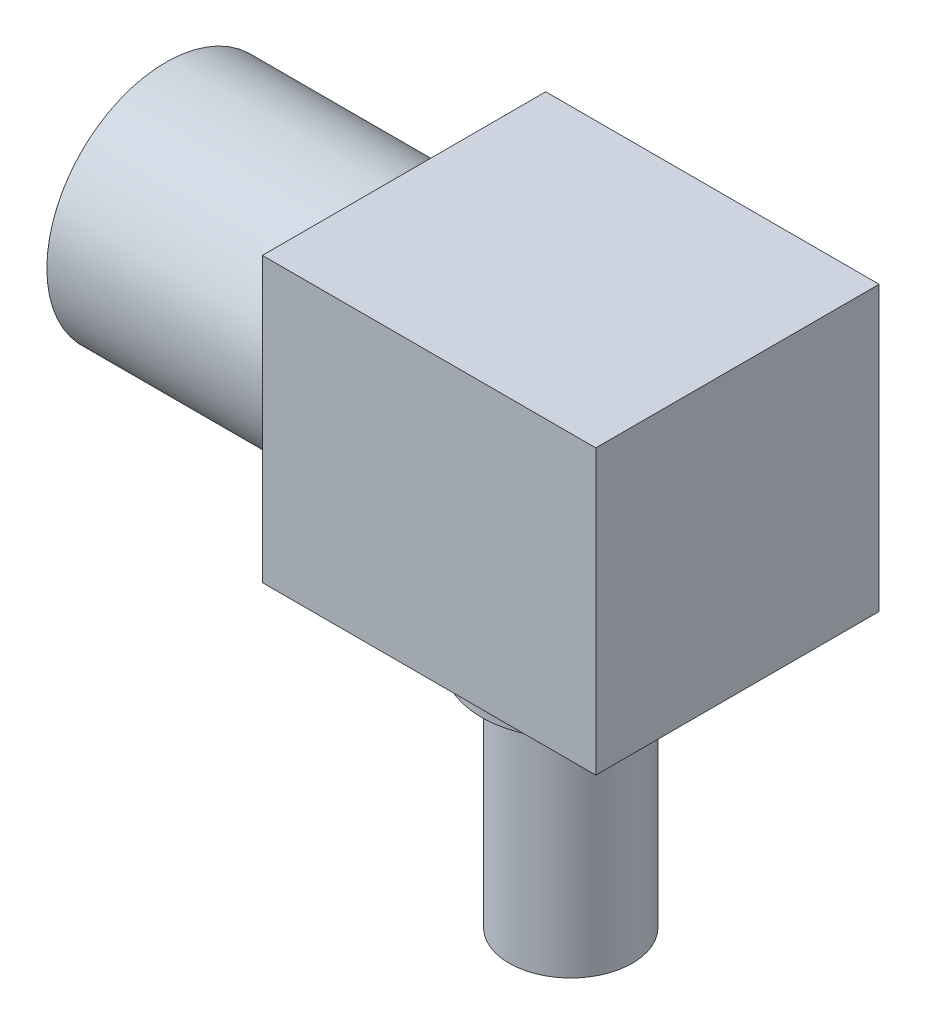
ISO-10303-21;
HEADER;
FILE_DESCRIPTION(('STEP AP214'),'2;1');
FILE_NAME('part.step','',(''),(''),'','','');
FILE_SCHEMA(('AUTOMOTIVE_DESIGN { 1 0 10303 214 1 1 1 1 }'));
ENDSEC;
DATA;
#1=APPLICATION_CONTEXT('core data for automotive mechanical design processes');
#2=APPLICATION_PROTOCOL_DEFINITION('international standard','automotive_design',2000,#1);
#3=PRODUCT_CONTEXT('',#1,'mechanical');
#4=PRODUCT('Part','Part','',(#3));
#5=PRODUCT_RELATED_PRODUCT_CATEGORY('part','',(#4));
#6=PRODUCT_DEFINITION_FORMATION('','',#4);
#7=PRODUCT_DEFINITION_CONTEXT('part definition',#1,'design');
#8=PRODUCT_DEFINITION('design','',#6,#7);
#9=PRODUCT_DEFINITION_SHAPE('','',#8);
#10=(LENGTH_UNIT() NAMED_UNIT(*) SI_UNIT(.MILLI.,.METRE.));
#11=(NAMED_UNIT(*) PLANE_ANGLE_UNIT() SI_UNIT($,.RADIAN.));
#12=(NAMED_UNIT(*) SI_UNIT($,.STERADIAN.) SOLID_ANGLE_UNIT());
#13=UNCERTAINTY_MEASURE_WITH_UNIT(LENGTH_MEASURE(1.E-05),#10,'distance_accuracy_value','');
#14=(GEOMETRIC_REPRESENTATION_CONTEXT(3) GLOBAL_UNCERTAINTY_ASSIGNED_CONTEXT((#13)) GLOBAL_UNIT_ASSIGNED_CONTEXT((#10,
#11,#12)) REPRESENTATION_CONTEXT('',''));
#15=CARTESIAN_POINT('',(0.,0.,0.));
#16=DIRECTION('',(0.,0.,1.));
#17=DIRECTION('',(1.,0.,0.));
#18=AXIS2_PLACEMENT_3D('',#15,#16,#17);
#19=CARTESIAN_POINT('',(-14.,28.8,11.9));
#20=DIRECTION('',(-1.,0.,0.));
#21=DIRECTION('',(0.,0.,1.));
#22=AXIS2_PLACEMENT_3D('',#19,#20,#21);
#23=PLANE('',#22);
#24=DIRECTION('',(0.,-1.,0.));
#25=VECTOR('',#24,1.);
#26=CARTESIAN_POINT('',(-14.,28.8,11.9));
#27=LINE('',#26,#25);
#28=CARTESIAN_POINT('',(-14.,28.8,11.9));
#29=VERTEX_POINT('',#28);
#30=CARTESIAN_POINT('',(-14.,5.,11.9));
#31=VERTEX_POINT('',#30);
#32=EDGE_CURVE('E78',#29,#31,#27,.T.);
#33=ORIENTED_EDGE('',*,*,#32,.F.);
#34=DIRECTION('',(0.,0.,1.));
#35=VECTOR('',#34,1.);
#36=CARTESIAN_POINT('',(-14.,28.8,-11.9));
#37=LINE('',#36,#35);
#38=CARTESIAN_POINT('',(-14.,28.8,-11.9));
#39=VERTEX_POINT('',#38);
#40=EDGE_CURVE('E105',#39,#29,#37,.T.);
#41=ORIENTED_EDGE('',*,*,#40,.F.);
#42=DIRECTION('',(0.,1.,0.));
#43=VECTOR('',#42,1.);
#44=CARTESIAN_POINT('',(-14.,28.8,-11.9));
#45=LINE('',#44,#43);
#46=CARTESIAN_POINT('',(-14.,5.,-11.9));
#47=VERTEX_POINT('',#46);
#48=EDGE_CURVE('E79',#47,#39,#45,.T.);
#49=ORIENTED_EDGE('',*,*,#48,.F.);
#50=DIRECTION('',(0.,0.,-1.));
#51=VECTOR('',#50,1.);
#52=CARTESIAN_POINT('',(-14.,5.,11.9));
#53=LINE('',#52,#51);
#54=EDGE_CURVE('E73',#31,#47,#53,.T.);
#55=ORIENTED_EDGE('',*,*,#54,.F.);
#56=EDGE_LOOP('',(#33,#41,#49,#55));
#57=FACE_BOUND('',#56,.T.);
#58=CARTESIAN_POINT('',(-14.,16.9,0.));
#59=DIRECTION('',(-1.,0.,0.));
#60=DIRECTION('',(0.,0.,1.));
#61=AXIS2_PLACEMENT_3D('',#58,#59,#60);
#62=CIRCLE('',#61,10.);
#63=CARTESIAN_POINT('',(-14.,16.9,10.));
#64=VERTEX_POINT('',#63);
#65=EDGE_CURVE('E100',#64,#64,#62,.T.);
#66=ORIENTED_EDGE('',*,*,#65,.F.);
#67=EDGE_LOOP('',(#66));
#68=FACE_BOUND('',#67,.T.);
#69=ADVANCED_FACE('F32',(#57,#68),#23,.T.);
#70=CARTESIAN_POINT('',(0.,0.,0.));
#71=DIRECTION('',(0.,1.,0.));
#72=DIRECTION('',(0.,0.,1.));
#73=AXIS2_PLACEMENT_3D('',#70,#71,#72);
#74=PLANE('',#73);
#75=CARTESIAN_POINT('',(0.,0.,0.));
#76=DIRECTION('',(0.,1.,0.));
#77=DIRECTION('',(0.,0.,1.));
#78=AXIS2_PLACEMENT_3D('',#75,#76,#77);
#79=CIRCLE('',#78,7.5);
#80=CARTESIAN_POINT('',(0.,0.,7.5));
#81=VERTEX_POINT('',#80);
#82=EDGE_CURVE('E119',#81,#81,#79,.T.);
#83=ORIENTED_EDGE('',*,*,#82,.F.);
#84=EDGE_LOOP('',(#83));
#85=FACE_BOUND('',#84,.T.);
#86=CARTESIAN_POINT('',(0.,0.,0.));
#87=DIRECTION('',(0.,1.,0.));
#88=DIRECTION('',(0.,0.,1.));
#89=AXIS2_PLACEMENT_3D('',#86,#87,#88);
#90=CIRCLE('',#89,5.1751600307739);
#91=CARTESIAN_POINT('',(0.,0.,5.1751600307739));
#92=VERTEX_POINT('',#91);
#93=EDGE_CURVE('E11',#92,#92,#90,.F.);
#94=ORIENTED_EDGE('',*,*,#93,.F.);
#95=EDGE_LOOP('',(#94));
#96=FACE_BOUND('',#95,.T.);
#97=ADVANCED_FACE('F127',(#85,#96),#74,.F.);
#98=CARTESIAN_POINT('',(0.,5.,0.));
#99=DIRECTION('',(0.,-1.,0.));
#100=DIRECTION('',(0.,0.,-1.));
#101=AXIS2_PLACEMENT_3D('',#98,#99,#100);
#102=CYLINDRICAL_SURFACE('',#101,7.5);
#103=CARTESIAN_POINT('',(0.,5.,0.));
#104=DIRECTION('',(0.,1.,0.));
#105=DIRECTION('',(0.,0.,1.));
#106=AXIS2_PLACEMENT_3D('',#103,#104,#105);
#107=CIRCLE('',#106,7.5);
#108=CARTESIAN_POINT('',(0.,5.,7.5));
#109=VERTEX_POINT('',#108);
#110=EDGE_CURVE('E40',#109,#109,#107,.T.);
#111=ORIENTED_EDGE('',*,*,#110,.F.);
#112=EDGE_LOOP('',(#111));
#113=FACE_BOUND('',#112,.T.);
#114=ORIENTED_EDGE('',*,*,#82,.T.);
#115=EDGE_LOOP('',(#114));
#116=FACE_BOUND('',#115,.T.);
#117=ADVANCED_FACE('F34',(#113,#116),#102,.T.);
#118=CARTESIAN_POINT('',(0.,-19.05,0.));
#119=DIRECTION('',(0.,1.,0.));
#120=DIRECTION('',(0.,0.,1.));
#121=AXIS2_PLACEMENT_3D('',#118,#119,#120);
#122=CYLINDRICAL_SURFACE('',#121,5.1751600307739);
#123=CARTESIAN_POINT('',(0.,-19.05,0.));
#124=DIRECTION('',(0.,-1.,0.));
#125=DIRECTION('',(0.,0.,-1.));
#126=AXIS2_PLACEMENT_3D('',#123,#124,#125);
#127=CIRCLE('',#126,5.1751600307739);
#128=CARTESIAN_POINT('',(0.,-19.05,5.1751600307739));
#129=VERTEX_POINT('',#128);
#130=EDGE_CURVE('E91',#129,#129,#127,.T.);
#131=CARTESIAN_POINT('',(0.,-19.05,5.1751600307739));
#132=CARTESIAN_POINT('',(0.,-18.8515625,5.1751600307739));
#133=CARTESIAN_POINT('',(0.,-18.653125,5.1751600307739));
#134=CARTESIAN_POINT('',(0.,-18.25625,5.1751600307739));
#135=CARTESIAN_POINT('',(0.,-18.0578125,5.1751600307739));
#136=CARTESIAN_POINT('',(0.,-17.6609375,5.1751600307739));
#137=CARTESIAN_POINT('',(0.,-17.4625,5.1751600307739));
#138=CARTESIAN_POINT('',(0.,-17.065625,5.1751600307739));
#139=CARTESIAN_POINT('',(0.,-16.8671875,5.1751600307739));
#140=CARTESIAN_POINT('',(0.,-16.4703125,5.1751600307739));
#141=CARTESIAN_POINT('',(0.,-16.271875,5.1751600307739));
#142=CARTESIAN_POINT('',(0.,-15.875,5.1751600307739));
#143=CARTESIAN_POINT('',(0.,-15.6765625,5.1751600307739));
#144=CARTESIAN_POINT('',(0.,-15.2796875,5.1751600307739));
#145=CARTESIAN_POINT('',(0.,-15.08125,5.1751600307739));
#146=CARTESIAN_POINT('',(0.,-14.684375,5.1751600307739));
#147=CARTESIAN_POINT('',(0.,-14.4859375,5.1751600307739));
#148=CARTESIAN_POINT('',(0.,-14.0890625,5.1751600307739));
#149=CARTESIAN_POINT('',(0.,-13.890625,5.1751600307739));
#150=CARTESIAN_POINT('',(0.,-13.49375,5.1751600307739));
#151=CARTESIAN_POINT('',(0.,-13.2953125,5.1751600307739));
#152=CARTESIAN_POINT('',(0.,-12.8984375,5.1751600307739));
#153=CARTESIAN_POINT('',(0.,-12.7,5.1751600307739));
#154=CARTESIAN_POINT('',(0.,-12.303125,5.1751600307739));
#155=CARTESIAN_POINT('',(0.,-12.1046875,5.1751600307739));
#156=CARTESIAN_POINT('',(0.,-11.7078125,5.1751600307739));
#157=CARTESIAN_POINT('',(0.,-11.509375,5.1751600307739));
#158=CARTESIAN_POINT('',(0.,-11.1125,5.1751600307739));
#159=CARTESIAN_POINT('',(0.,-10.9140625,5.1751600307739));
#160=CARTESIAN_POINT('',(0.,-10.5171875,5.1751600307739));
#161=CARTESIAN_POINT('',(0.,-10.31875,5.1751600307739));
#162=CARTESIAN_POINT('',(0.,-9.921875,5.1751600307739));
#163=CARTESIAN_POINT('',(0.,-9.7234375,5.1751600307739));
#164=CARTESIAN_POINT('',(0.,-9.3265625,5.1751600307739));
#165=CARTESIAN_POINT('',(0.,-9.128125,5.1751600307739));
#166=CARTESIAN_POINT('',(0.,-8.73125,5.1751600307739));
#167=CARTESIAN_POINT('',(0.,-8.5328125,5.1751600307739));
#168=CARTESIAN_POINT('',(0.,-8.1359375,5.1751600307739));
#169=CARTESIAN_POINT('',(0.,-7.9375,5.1751600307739));
#170=CARTESIAN_POINT('',(0.,-7.540625,5.1751600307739));
#171=CARTESIAN_POINT('',(0.,-7.3421875,5.1751600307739));
#172=CARTESIAN_POINT('',(0.,-6.9453125,5.1751600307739));
#173=CARTESIAN_POINT('',(0.,-6.746875,5.1751600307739));
#174=CARTESIAN_POINT('',(0.,-6.35,5.1751600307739));
#175=CARTESIAN_POINT('',(0.,-6.1515625,5.1751600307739));
#176=CARTESIAN_POINT('',(0.,-5.7546875,5.1751600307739));
#177=CARTESIAN_POINT('',(0.,-5.55625,5.1751600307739));
#178=CARTESIAN_POINT('',(0.,-5.159375,5.1751600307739));
#179=CARTESIAN_POINT('',(0.,-4.9609375,5.1751600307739));
#180=CARTESIAN_POINT('',(0.,-4.5640625,5.1751600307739));
#181=CARTESIAN_POINT('',(0.,-4.365625,5.1751600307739));
#182=CARTESIAN_POINT('',(0.,-3.96875,5.1751600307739));
#183=CARTESIAN_POINT('',(0.,-3.7703125,5.1751600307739));
#184=CARTESIAN_POINT('',(0.,-3.3734375,5.1751600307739));
#185=CARTESIAN_POINT('',(0.,-3.175,5.1751600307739));
#186=CARTESIAN_POINT('',(0.,-2.778125,5.1751600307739));
#187=CARTESIAN_POINT('',(0.,-2.5796875,5.1751600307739));
#188=CARTESIAN_POINT('',(0.,-2.1828125,5.1751600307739));
#189=CARTESIAN_POINT('',(0.,-1.984375,5.1751600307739));
#190=CARTESIAN_POINT('',(0.,-1.5875,5.1751600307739));
#191=CARTESIAN_POINT('',(0.,-1.3890625,5.1751600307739));
#192=CARTESIAN_POINT('',(0.,-0.992187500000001,5.1751600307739));
#193=CARTESIAN_POINT('',(0.,-0.793750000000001,5.1751600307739));
#194=CARTESIAN_POINT('',(0.,-0.396875,5.1751600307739));
#195=CARTESIAN_POINT('',(0.,-0.1984375,5.1751600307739));
#196=CARTESIAN_POINT('',(0.,0.,5.1751600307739));
#197=B_SPLINE_CURVE_WITH_KNOTS('',3,(#131,#132,#133,#134,#135,#136,#137,#138,#139,#140,#141,
#142,#143,#144,#145,#146,#147,#148,#149,#150,#151,#152,#153,#154,#155,#156,#157,#158,#159,#160,
#161,#162,#163,#164,#165,#166,#167,#168,#169,#170,#171,#172,#173,#174,#175,#176,#177,#178,#179,
#180,#181,#182,#183,#184,#185,#186,#187,#188,#189,#190,#191,#192,#193,#194,#195,#196),
.UNSPECIFIED.,.F.,.F.,(4,2,2,2,2,2,2,2,2,2,2,2,2,2,2,2,2,2,2,2,2,2,2,2,2,2,2,2,2,2,2,2,4),(0.,
0.595312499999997,1.190625,1.7859375,2.38125,2.9765625,3.571875,4.1671875,4.7625,5.3578125,
5.953125,6.5484375,7.14375,7.7390625,8.334375,8.9296875,9.525,10.1203125,10.715625,11.3109375,
11.90625,12.5015625,13.096875,13.6921875,14.2875,14.8828125,15.478125,16.0734375,16.66875,
17.2640625,17.859375,18.4546875,19.05),.UNSPECIFIED.);
#198=EDGE_CURVE('BSEAM126',#129,#92,#197,.T.);
#199=ORIENTED_EDGE('',*,*,#130,.F.);
#200=ORIENTED_EDGE('',*,*,#93,.T.);
#201=ORIENTED_EDGE('',*,*,#198,.T.);
#202=ORIENTED_EDGE('',*,*,#198,.F.);
#203=EDGE_LOOP('',(#199,#201,#200,#202));
#204=FACE_BOUND('',#203,.T.);
#205=ADVANCED_FACE('F126',(#204),#122,.T.);
#206=CARTESIAN_POINT('',(0.,-19.05,0.));
#207=DIRECTION('',(0.,-1.,0.));
#208=DIRECTION('',(0.,0.,-1.));
#209=AXIS2_PLACEMENT_3D('',#206,#207,#208);
#210=PLANE('',#209);
#211=ORIENTED_EDGE('',*,*,#130,.T.);
#212=EDGE_LOOP('',(#211));
#213=FACE_BOUND('',#212,.T.);
#214=ADVANCED_FACE('F135',(#213),#210,.T.);
#215=CARTESIAN_POINT('',(14.,5.,11.9));
#216=DIRECTION('',(0.,1.,0.));
#217=DIRECTION('',(0.,0.,1.));
#218=AXIS2_PLACEMENT_3D('',#215,#216,#217);
#219=PLANE('',#218);
#220=ORIENTED_EDGE('',*,*,#54,.T.);
#221=DIRECTION('',(-1.,0.,0.));
#222=VECTOR('',#221,1.);
#223=CARTESIAN_POINT('',(14.,5.,-11.9));
#224=LINE('',#223,#222);
#225=CARTESIAN_POINT('',(14.,5.,-11.9));
#226=VERTEX_POINT('',#225);
#227=EDGE_CURVE('E92',#226,#47,#224,.T.);
#228=ORIENTED_EDGE('',*,*,#227,.F.);
#229=DIRECTION('',(0.,0.,-1.));
#230=VECTOR('',#229,1.);
#231=CARTESIAN_POINT('',(14.,5.,11.9));
#232=LINE('',#231,#230);
#233=CARTESIAN_POINT('',(14.,5.,11.9));
#234=VERTEX_POINT('',#233);
#235=EDGE_CURVE('E88',#234,#226,#232,.T.);
#236=ORIENTED_EDGE('',*,*,#235,.F.);
#237=DIRECTION('',(-1.,0.,0.));
#238=VECTOR('',#237,1.);
#239=CARTESIAN_POINT('',(14.,5.,11.9));
#240=LINE('',#239,#238);
#241=EDGE_CURVE('E85',#234,#31,#240,.T.);
#242=ORIENTED_EDGE('',*,*,#241,.T.);
#243=EDGE_LOOP('',(#220,#228,#236,#242));
#244=FACE_BOUND('',#243,.T.);
#245=ORIENTED_EDGE('',*,*,#110,.T.);
#246=EDGE_LOOP('',(#245));
#247=FACE_BOUND('',#246,.T.);
#248=ADVANCED_FACE('F86',(#244,#247),#219,.F.);
#249=CARTESIAN_POINT('',(14.,28.8,11.9));
#250=DIRECTION('',(0.,0.,-1.));
#251=DIRECTION('',(0.,1.,0.));
#252=AXIS2_PLACEMENT_3D('',#249,#250,#251);
#253=PLANE('',#252);
#254=ORIENTED_EDGE('',*,*,#32,.T.);
#255=ORIENTED_EDGE('',*,*,#241,.F.);
#256=DIRECTION('',(0.,-1.,0.));
#257=VECTOR('',#256,1.);
#258=CARTESIAN_POINT('',(14.,28.8,11.9));
#259=LINE('',#258,#257);
#260=CARTESIAN_POINT('',(14.,28.8,11.9));
#261=VERTEX_POINT('',#260);
#262=EDGE_CURVE('E107',#261,#234,#259,.T.);
#263=ORIENTED_EDGE('',*,*,#262,.F.);
#264=DIRECTION('',(-1.,0.,0.));
#265=VECTOR('',#264,1.);
#266=CARTESIAN_POINT('',(14.,28.8,11.9));
#267=LINE('',#266,#265);
#268=EDGE_CURVE('E96',#261,#29,#267,.T.);
#269=ORIENTED_EDGE('',*,*,#268,.T.);
#270=EDGE_LOOP('',(#254,#255,#263,#269));
#271=FACE_BOUND('',#270,.T.);
#272=ADVANCED_FACE('F95',(#271),#253,.F.);
#273=CARTESIAN_POINT('',(14.,28.8,-11.9));
#274=DIRECTION('',(0.,0.,1.));
#275=DIRECTION('',(0.,-1.,0.));
#276=AXIS2_PLACEMENT_3D('',#273,#274,#275);
#277=PLANE('',#276);
#278=ORIENTED_EDGE('',*,*,#48,.T.);
#279=DIRECTION('',(-1.,0.,0.));
#280=VECTOR('',#279,1.);
#281=CARTESIAN_POINT('',(14.,28.8,-11.9));
#282=LINE('',#281,#280);
#283=CARTESIAN_POINT('',(14.,28.8,-11.9));
#284=VERTEX_POINT('',#283);
#285=EDGE_CURVE('E113',#284,#39,#282,.T.);
#286=ORIENTED_EDGE('',*,*,#285,.F.);
#287=DIRECTION('',(0.,1.,0.));
#288=VECTOR('',#287,1.);
#289=CARTESIAN_POINT('',(14.,28.8,-11.9));
#290=LINE('',#289,#288);
#291=EDGE_CURVE('E52',#226,#284,#290,.T.);
#292=ORIENTED_EDGE('',*,*,#291,.F.);
#293=ORIENTED_EDGE('',*,*,#227,.T.);
#294=EDGE_LOOP('',(#278,#286,#292,#293));
#295=FACE_BOUND('',#294,.T.);
#296=ADVANCED_FACE('F158',(#295),#277,.F.);
#297=CARTESIAN_POINT('',(14.,28.8,-11.9));
#298=DIRECTION('',(0.,-1.,0.));
#299=DIRECTION('',(0.,0.,-1.));
#300=AXIS2_PLACEMENT_3D('',#297,#298,#299);
#301=PLANE('',#300);
#302=ORIENTED_EDGE('',*,*,#40,.T.);
#303=ORIENTED_EDGE('',*,*,#268,.F.);
#304=DIRECTION('',(0.,0.,1.));
#305=VECTOR('',#304,1.);
#306=CARTESIAN_POINT('',(14.,28.8,-11.9));
#307=LINE('',#306,#305);
#308=EDGE_CURVE('E47',#284,#261,#307,.T.);
#309=ORIENTED_EDGE('',*,*,#308,.F.);
#310=ORIENTED_EDGE('',*,*,#285,.T.);
#311=EDGE_LOOP('',(#302,#303,#309,#310));
#312=FACE_BOUND('',#311,.T.);
#313=ADVANCED_FACE('F155',(#312),#301,.F.);
#314=CARTESIAN_POINT('',(14.,28.8,11.9));
#315=DIRECTION('',(-1.,0.,0.));
#316=DIRECTION('',(0.,0.,1.));
#317=AXIS2_PLACEMENT_3D('',#314,#315,#316);
#318=PLANE('',#317);
#319=ORIENTED_EDGE('',*,*,#262,.T.);
#320=ORIENTED_EDGE('',*,*,#235,.T.);
#321=ORIENTED_EDGE('',*,*,#291,.T.);
#322=ORIENTED_EDGE('',*,*,#308,.T.);
#323=EDGE_LOOP('',(#319,#320,#321,#322));
#324=FACE_BOUND('',#323,.T.);
#325=ADVANCED_FACE('F152',(#324),#318,.F.);
#326=CARTESIAN_POINT('',(-34.,16.9,0.));
#327=DIRECTION('',(1.,0.,0.));
#328=DIRECTION('',(0.,0.,-1.));
#329=AXIS2_PLACEMENT_3D('',#326,#327,#328);
#330=CYLINDRICAL_SURFACE('',#329,10.);
#331=CARTESIAN_POINT('',(-34.,16.9,0.));
#332=DIRECTION('',(-1.,0.,0.));
#333=DIRECTION('',(0.,0.,1.));
#334=AXIS2_PLACEMENT_3D('',#331,#332,#333);
#335=CIRCLE('',#334,10.);
#336=CARTESIAN_POINT('',(-34.,16.9,10.));
#337=VERTEX_POINT('',#336);
#338=EDGE_CURVE('E97',#337,#337,#335,.T.);
#339=ORIENTED_EDGE('',*,*,#338,.F.);
#340=EDGE_LOOP('',(#339));
#341=FACE_BOUND('',#340,.T.);
#342=ORIENTED_EDGE('',*,*,#65,.T.);
#343=EDGE_LOOP('',(#342));
#344=FACE_BOUND('',#343,.T.);
#345=ADVANCED_FACE('F150',(#341,#344),#330,.T.);
#346=CARTESIAN_POINT('',(-34.,16.9,0.));
#347=DIRECTION('',(-1.,0.,0.));
#348=DIRECTION('',(0.,0.,1.));
#349=AXIS2_PLACEMENT_3D('',#346,#347,#348);
#350=PLANE('',#349);
#351=CARTESIAN_POINT('',(-34.,22.5568542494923,5.65685424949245));
#352=DIRECTION('',(-1.,0.,0.));
#353=DIRECTION('',(0.,0.707106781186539,0.707106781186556));
#354=AXIS2_PLACEMENT_3D('',#351,#352,#353);
#355=CIRCLE('',#354,0.703214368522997);
#356=CARTESIAN_POINT('',(-34.,23.0541018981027,6.15410189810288));
#357=VERTEX_POINT('',#356);
#358=EDGE_CURVE('E403',#357,#357,#355,.T.);
#359=ORIENTED_EDGE('',*,*,#358,.F.);
#360=EDGE_LOOP('',(#359));
#361=FACE_BOUND('',#360,.T.);
#362=CARTESIAN_POINT('',(-34.,24.9,0.));
#363=DIRECTION('',(-1.,0.,0.));
#364=DIRECTION('',(0.,1.,0.));
#365=AXIS2_PLACEMENT_3D('',#362,#363,#364);
#366=CIRCLE('',#365,0.703214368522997);
#367=CARTESIAN_POINT('',(-34.,25.603214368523,0.));
#368=VERTEX_POINT('',#367);
#369=EDGE_CURVE('E402',#368,#368,#366,.T.);
#370=ORIENTED_EDGE('',*,*,#369,.F.);
#371=EDGE_LOOP('',(#370));
#372=FACE_BOUND('',#371,.T.);
#373=CARTESIAN_POINT('',(-34.,22.5568542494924,-5.65685424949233));
#374=DIRECTION('',(-1.,0.,0.));
#375=DIRECTION('',(0.,0.707106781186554,-0.707106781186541));
#376=AXIS2_PLACEMENT_3D('',#373,#374,#375);
#377=CIRCLE('',#376,0.703214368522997);
#378=CARTESIAN_POINT('',(-34.,23.0541018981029,-6.15410189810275));
#379=VERTEX_POINT('',#378);
#380=EDGE_CURVE('E413',#379,#379,#377,.T.);
#381=ORIENTED_EDGE('',*,*,#380,.F.);
#382=EDGE_LOOP('',(#381));
#383=FACE_BOUND('',#382,.T.);
#384=CARTESIAN_POINT('',(-34.,16.9000000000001,-8.));
#385=DIRECTION('',(-1.,0.,0.));
#386=DIRECTION('',(0.,0.,-1.));
#387=AXIS2_PLACEMENT_3D('',#384,#385,#386);
#388=CIRCLE('',#387,0.703214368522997);
#389=CARTESIAN_POINT('',(-34.,16.9000000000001,-8.703214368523));
#390=VERTEX_POINT('',#389);
#391=EDGE_CURVE('E419',#390,#390,#388,.T.);
#392=ORIENTED_EDGE('',*,*,#391,.F.);
#393=EDGE_LOOP('',(#392));
#394=FACE_BOUND('',#393,.T.);
#395=CARTESIAN_POINT('',(-34.,11.2431457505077,-5.65685424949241));
#396=DIRECTION('',(-1.,0.,0.));
#397=DIRECTION('',(0.,-0.707106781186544,-0.707106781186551));
#398=AXIS2_PLACEMENT_3D('',#395,#396,#397);
#399=CIRCLE('',#398,0.703214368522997);
#400=CARTESIAN_POINT('',(-34.,10.7458981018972,-6.15410189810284));
#401=VERTEX_POINT('',#400);
#402=EDGE_CURVE('E425',#401,#401,#399,.T.);
#403=ORIENTED_EDGE('',*,*,#402,.F.);
#404=EDGE_LOOP('',(#403));
#405=FACE_BOUND('',#404,.T.);
#406=CARTESIAN_POINT('',(-34.,8.9,0.));
#407=DIRECTION('',(-1.,0.,0.));
#408=DIRECTION('',(0.,-1.,0.));
#409=AXIS2_PLACEMENT_3D('',#406,#407,#408);
#410=CIRCLE('',#409,0.703214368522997);
#411=CARTESIAN_POINT('',(-34.,8.196785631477,0.));
#412=VERTEX_POINT('',#411);
#413=EDGE_CURVE('E431',#412,#412,#410,.T.);
#414=ORIENTED_EDGE('',*,*,#413,.F.);
#415=EDGE_LOOP('',(#414));
#416=FACE_BOUND('',#415,.T.);
#417=CARTESIAN_POINT('',(-34.,11.2431457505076,5.65685424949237));
#418=DIRECTION('',(-1.,0.,0.));
#419=DIRECTION('',(0.,-0.707106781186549,0.707106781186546));
#420=AXIS2_PLACEMENT_3D('',#417,#418,#419);
#421=CIRCLE('',#420,0.703214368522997);
#422=CARTESIAN_POINT('',(-34.,10.7458981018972,6.15410189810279));
#423=VERTEX_POINT('',#422);
#424=EDGE_CURVE('E437',#423,#423,#421,.T.);
#425=ORIENTED_EDGE('',*,*,#424,.F.);
#426=EDGE_LOOP('',(#425));
#427=FACE_BOUND('',#426,.T.);
#428=CARTESIAN_POINT('',(-34.,16.9,8.));
#429=DIRECTION('',(-1.,0.,0.));
#430=DIRECTION('',(0.,0.,1.));
#431=AXIS2_PLACEMENT_3D('',#428,#429,#430);
#432=CIRCLE('',#431,0.703214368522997);
#433=CARTESIAN_POINT('',(-34.,16.9,8.703214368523));
#434=VERTEX_POINT('',#433);
#435=EDGE_CURVE('E443',#434,#434,#432,.T.);
#436=ORIENTED_EDGE('',*,*,#435,.F.);
#437=EDGE_LOOP('',(#436));
#438=FACE_BOUND('',#437,.T.);
#439=ORIENTED_EDGE('',*,*,#338,.T.);
#440=EDGE_LOOP('',(#439));
#441=FACE_BOUND('',#440,.T.);
#442=ADVANCED_FACE('F188',(#361,#372,#383,#394,#405,#416,#427,#438,#441),#350,.T.);
#443=CARTESIAN_POINT('',(-24.,16.9,8.));
#444=DIRECTION('',(-1.,0.,0.));
#445=DIRECTION('',(0.,0.,1.));
#446=AXIS2_PLACEMENT_3D('',#443,#444,#445);
#447=CYLINDRICAL_SURFACE('',#446,0.703214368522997);
#448=CARTESIAN_POINT('',(-24.,16.9,8.));
#449=DIRECTION('',(-1.,0.,0.));
#450=DIRECTION('',(0.,0.,1.));
#451=AXIS2_PLACEMENT_3D('',#448,#449,#450);
#452=CIRCLE('',#451,0.703214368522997);
#453=CARTESIAN_POINT('',(-24.,16.9,8.703214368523));
#454=VERTEX_POINT('',#453);
#455=EDGE_CURVE('E446',#454,#454,#452,.T.);
#456=ORIENTED_EDGE('',*,*,#455,.F.);
#457=EDGE_LOOP('',(#456));
#458=FACE_BOUND('',#457,.T.);
#459=ORIENTED_EDGE('',*,*,#435,.T.);
#460=EDGE_LOOP('',(#459));
#461=FACE_BOUND('',#460,.T.);
#462=ADVANCED_FACE('F196',(#458,#461),#447,.F.);
#463=CARTESIAN_POINT('',(-24.,16.9,8.));
#464=DIRECTION('',(-1.,0.,0.));
#465=DIRECTION('',(0.,0.,1.));
#466=AXIS2_PLACEMENT_3D('',#463,#464,#465);
#467=PLANE('',#466);
#468=ORIENTED_EDGE('',*,*,#455,.T.);
#469=EDGE_LOOP('',(#468));
#470=FACE_BOUND('',#469,.T.);
#471=ADVANCED_FACE('F204',(#470),#467,.T.);
#472=CARTESIAN_POINT('',(-24.,11.2431457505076,5.65685424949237));
#473=DIRECTION('',(-1.,0.,0.));
#474=DIRECTION('',(0.,0.,1.));
#475=AXIS2_PLACEMENT_3D('',#472,#473,#474);
#476=CYLINDRICAL_SURFACE('',#475,0.703214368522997);
#477=CARTESIAN_POINT('',(-24.,11.2431457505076,5.65685424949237));
#478=DIRECTION('',(-1.,0.,0.));
#479=DIRECTION('',(0.,-0.707106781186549,0.707106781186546));
#480=AXIS2_PLACEMENT_3D('',#477,#478,#479);
#481=CIRCLE('',#480,0.703214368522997);
#482=CARTESIAN_POINT('',(-24.,10.7458981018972,6.15410189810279));
#483=VERTEX_POINT('',#482);
#484=EDGE_CURVE('E440',#483,#483,#481,.T.);
#485=ORIENTED_EDGE('',*,*,#484,.F.);
#486=EDGE_LOOP('',(#485));
#487=FACE_BOUND('',#486,.T.);
#488=ORIENTED_EDGE('',*,*,#424,.T.);
#489=EDGE_LOOP('',(#488));
#490=FACE_BOUND('',#489,.T.);
#491=ADVANCED_FACE('F211',(#487,#490),#476,.F.);
#492=CARTESIAN_POINT('',(-24.,11.2431457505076,5.65685424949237));
#493=DIRECTION('',(-1.,0.,0.));
#494=DIRECTION('',(0.,-0.707106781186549,0.707106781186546));
#495=AXIS2_PLACEMENT_3D('',#492,#493,#494);
#496=PLANE('',#495);
#497=ORIENTED_EDGE('',*,*,#484,.T.);
#498=EDGE_LOOP('',(#497));
#499=FACE_BOUND('',#498,.T.);
#500=ADVANCED_FACE('F218',(#499),#496,.T.);
#501=CARTESIAN_POINT('',(-24.,8.9,0.));
#502=DIRECTION('',(-1.,0.,0.));
#503=DIRECTION('',(0.,0.,1.));
#504=AXIS2_PLACEMENT_3D('',#501,#502,#503);
#505=CYLINDRICAL_SURFACE('',#504,0.703214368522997);
#506=CARTESIAN_POINT('',(-24.,8.9,0.));
#507=DIRECTION('',(-1.,0.,0.));
#508=DIRECTION('',(0.,-1.,0.));
#509=AXIS2_PLACEMENT_3D('',#506,#507,#508);
#510=CIRCLE('',#509,0.703214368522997);
#511=CARTESIAN_POINT('',(-24.,8.196785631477,0.));
#512=VERTEX_POINT('',#511);
#513=EDGE_CURVE('E434',#512,#512,#510,.T.);
#514=ORIENTED_EDGE('',*,*,#513,.F.);
#515=EDGE_LOOP('',(#514));
#516=FACE_BOUND('',#515,.T.);
#517=ORIENTED_EDGE('',*,*,#413,.T.);
#518=EDGE_LOOP('',(#517));
#519=FACE_BOUND('',#518,.T.);
#520=ADVANCED_FACE('F226',(#516,#519),#505,.F.);
#521=CARTESIAN_POINT('',(-24.,8.9,0.));
#522=DIRECTION('',(-1.,0.,0.));
#523=DIRECTION('',(0.,-1.,0.));
#524=AXIS2_PLACEMENT_3D('',#521,#522,#523);
#525=PLANE('',#524);
#526=ORIENTED_EDGE('',*,*,#513,.T.);
#527=EDGE_LOOP('',(#526));
#528=FACE_BOUND('',#527,.T.);
#529=ADVANCED_FACE('F234',(#528),#525,.T.);
#530=CARTESIAN_POINT('',(-24.,11.2431457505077,-5.65685424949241));
#531=DIRECTION('',(-1.,0.,0.));
#532=DIRECTION('',(0.,0.,1.));
#533=AXIS2_PLACEMENT_3D('',#530,#531,#532);
#534=CYLINDRICAL_SURFACE('',#533,0.703214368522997);
#535=CARTESIAN_POINT('',(-24.,11.2431457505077,-5.65685424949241));
#536=DIRECTION('',(-1.,0.,0.));
#537=DIRECTION('',(0.,-0.707106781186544,-0.707106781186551));
#538=AXIS2_PLACEMENT_3D('',#535,#536,#537);
#539=CIRCLE('',#538,0.703214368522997);
#540=CARTESIAN_POINT('',(-24.,10.7458981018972,-6.15410189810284));
#541=VERTEX_POINT('',#540);
#542=EDGE_CURVE('E428',#541,#541,#539,.T.);
#543=ORIENTED_EDGE('',*,*,#542,.F.);
#544=EDGE_LOOP('',(#543));
#545=FACE_BOUND('',#544,.T.);
#546=ORIENTED_EDGE('',*,*,#402,.T.);
#547=EDGE_LOOP('',(#546));
#548=FACE_BOUND('',#547,.T.);
#549=ADVANCED_FACE('F242',(#545,#548),#534,.F.);
#550=CARTESIAN_POINT('',(-24.,11.2431457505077,-5.65685424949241));
#551=DIRECTION('',(-1.,0.,0.));
#552=DIRECTION('',(0.,-0.707106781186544,-0.707106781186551));
#553=AXIS2_PLACEMENT_3D('',#550,#551,#552);
#554=PLANE('',#553);
#555=ORIENTED_EDGE('',*,*,#542,.T.);
#556=EDGE_LOOP('',(#555));
#557=FACE_BOUND('',#556,.T.);
#558=ADVANCED_FACE('F250',(#557),#554,.T.);
#559=CARTESIAN_POINT('',(-24.,16.9000000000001,-8.));
#560=DIRECTION('',(-1.,0.,0.));
#561=DIRECTION('',(0.,0.,1.));
#562=AXIS2_PLACEMENT_3D('',#559,#560,#561);
#563=CYLINDRICAL_SURFACE('',#562,0.703214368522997);
#564=CARTESIAN_POINT('',(-24.,16.9000000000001,-8.));
#565=DIRECTION('',(-1.,0.,0.));
#566=DIRECTION('',(0.,0.,-1.));
#567=AXIS2_PLACEMENT_3D('',#564,#565,#566);
#568=CIRCLE('',#567,0.703214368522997);
#569=CARTESIAN_POINT('',(-24.,16.9000000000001,-8.703214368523));
#570=VERTEX_POINT('',#569);
#571=EDGE_CURVE('E422',#570,#570,#568,.T.);
#572=ORIENTED_EDGE('',*,*,#571,.F.);
#573=EDGE_LOOP('',(#572));
#574=FACE_BOUND('',#573,.T.);
#575=ORIENTED_EDGE('',*,*,#391,.T.);
#576=EDGE_LOOP('',(#575));
#577=FACE_BOUND('',#576,.T.);
#578=ADVANCED_FACE('F258',(#574,#577),#563,.F.);
#579=CARTESIAN_POINT('',(-24.,16.9000000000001,-8.));
#580=DIRECTION('',(-1.,0.,0.));
#581=DIRECTION('',(0.,0.,-1.));
#582=AXIS2_PLACEMENT_3D('',#579,#580,#581);
#583=PLANE('',#582);
#584=ORIENTED_EDGE('',*,*,#571,.T.);
#585=EDGE_LOOP('',(#584));
#586=FACE_BOUND('',#585,.T.);
#587=ADVANCED_FACE('F266',(#586),#583,.T.);
#588=CARTESIAN_POINT('',(-24.,22.5568542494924,-5.65685424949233));
#589=DIRECTION('',(-1.,0.,0.));
#590=DIRECTION('',(0.,0.,1.));
#591=AXIS2_PLACEMENT_3D('',#588,#589,#590);
#592=CYLINDRICAL_SURFACE('',#591,0.703214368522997);
#593=CARTESIAN_POINT('',(-24.,22.5568542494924,-5.65685424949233));
#594=DIRECTION('',(-1.,0.,0.));
#595=DIRECTION('',(0.,0.707106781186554,-0.707106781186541));
#596=AXIS2_PLACEMENT_3D('',#593,#594,#595);
#597=CIRCLE('',#596,0.703214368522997);
#598=CARTESIAN_POINT('',(-24.,23.0541018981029,-6.15410189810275));
#599=VERTEX_POINT('',#598);
#600=EDGE_CURVE('E416',#599,#599,#597,.T.);
#601=ORIENTED_EDGE('',*,*,#600,.F.);
#602=EDGE_LOOP('',(#601));
#603=FACE_BOUND('',#602,.T.);
#604=ORIENTED_EDGE('',*,*,#380,.T.);
#605=EDGE_LOOP('',(#604));
#606=FACE_BOUND('',#605,.T.);
#607=ADVANCED_FACE('F274',(#603,#606),#592,.F.);
#608=CARTESIAN_POINT('',(-24.,22.5568542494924,-5.65685424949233));
#609=DIRECTION('',(-1.,0.,0.));
#610=DIRECTION('',(0.,0.707106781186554,-0.707106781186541));
#611=AXIS2_PLACEMENT_3D('',#608,#609,#610);
#612=PLANE('',#611);
#613=ORIENTED_EDGE('',*,*,#600,.T.);
#614=EDGE_LOOP('',(#613));
#615=FACE_BOUND('',#614,.T.);
#616=ADVANCED_FACE('F282',(#615),#612,.T.);
#617=CARTESIAN_POINT('',(-24.,24.9,0.));
#618=DIRECTION('',(-1.,0.,0.));
#619=DIRECTION('',(0.,0.,1.));
#620=AXIS2_PLACEMENT_3D('',#617,#618,#619);
#621=CYLINDRICAL_SURFACE('',#620,0.703214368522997);
#622=CARTESIAN_POINT('',(-24.,24.9,0.));
#623=DIRECTION('',(-1.,0.,0.));
#624=DIRECTION('',(0.,1.,0.));
#625=AXIS2_PLACEMENT_3D('',#622,#623,#624);
#626=CIRCLE('',#625,0.703214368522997);
#627=CARTESIAN_POINT('',(-24.,25.603214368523,0.));
#628=VERTEX_POINT('',#627);
#629=EDGE_CURVE('E406',#628,#628,#626,.T.);
#630=ORIENTED_EDGE('',*,*,#629,.F.);
#631=EDGE_LOOP('',(#630));
#632=FACE_BOUND('',#631,.T.);
#633=ORIENTED_EDGE('',*,*,#369,.T.);
#634=EDGE_LOOP('',(#633));
#635=FACE_BOUND('',#634,.T.);
#636=ADVANCED_FACE('F290',(#632,#635),#621,.F.);
#637=CARTESIAN_POINT('',(-24.,24.9,0.));
#638=DIRECTION('',(-1.,0.,0.));
#639=DIRECTION('',(0.,1.,0.));
#640=AXIS2_PLACEMENT_3D('',#637,#638,#639);
#641=PLANE('',#640);
#642=ORIENTED_EDGE('',*,*,#629,.T.);
#643=EDGE_LOOP('',(#642));
#644=FACE_BOUND('',#643,.T.);
#645=ADVANCED_FACE('F298',(#644),#641,.T.);
#646=CARTESIAN_POINT('',(-24.,22.5568542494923,5.65685424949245));
#647=DIRECTION('',(-1.,0.,0.));
#648=DIRECTION('',(0.,0.,1.));
#649=AXIS2_PLACEMENT_3D('',#646,#647,#648);
#650=CYLINDRICAL_SURFACE('',#649,0.703214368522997);
#651=CARTESIAN_POINT('',(-24.,22.5568542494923,5.65685424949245));
#652=DIRECTION('',(-1.,0.,0.));
#653=DIRECTION('',(0.,0.707106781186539,0.707106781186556));
#654=AXIS2_PLACEMENT_3D('',#651,#652,#653);
#655=CIRCLE('',#654,0.703214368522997);
#656=CARTESIAN_POINT('',(-24.,23.0541018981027,6.15410189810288));
#657=VERTEX_POINT('',#656);
#658=EDGE_CURVE('E401',#657,#657,#655,.T.);
#659=ORIENTED_EDGE('',*,*,#658,.F.);
#660=EDGE_LOOP('',(#659));
#661=FACE_BOUND('',#660,.T.);
#662=ORIENTED_EDGE('',*,*,#358,.T.);
#663=EDGE_LOOP('',(#662));
#664=FACE_BOUND('',#663,.T.);
#665=ADVANCED_FACE('F306',(#661,#664),#650,.F.);
#666=CARTESIAN_POINT('',(-24.,22.5568542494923,5.65685424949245));
#667=DIRECTION('',(-1.,0.,0.));
#668=DIRECTION('',(0.,0.707106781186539,0.707106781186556));
#669=AXIS2_PLACEMENT_3D('',#666,#667,#668);
#670=PLANE('',#669);
#671=ORIENTED_EDGE('',*,*,#658,.T.);
#672=EDGE_LOOP('',(#671));
#673=FACE_BOUND('',#672,.T.);
#674=ADVANCED_FACE('F314',(#673),#670,.T.);
#675=CLOSED_SHELL('',(#69,#97,#117,#205,#214,#248,#272,#296,#313,#325,#345,#442,#462,#471,#491,
#500,#520,#529,#549,#558,#578,#587,#607,#616,#636,#645,#665,#674));
#676=MANIFOLD_SOLID_BREP('B2',#675);
#677=ADVANCED_BREP_SHAPE_REPRESENTATION('',(#18,#676),#14);
#678=SHAPE_DEFINITION_REPRESENTATION(#9,#677);
ENDSEC;
END-ISO-10303-21;
